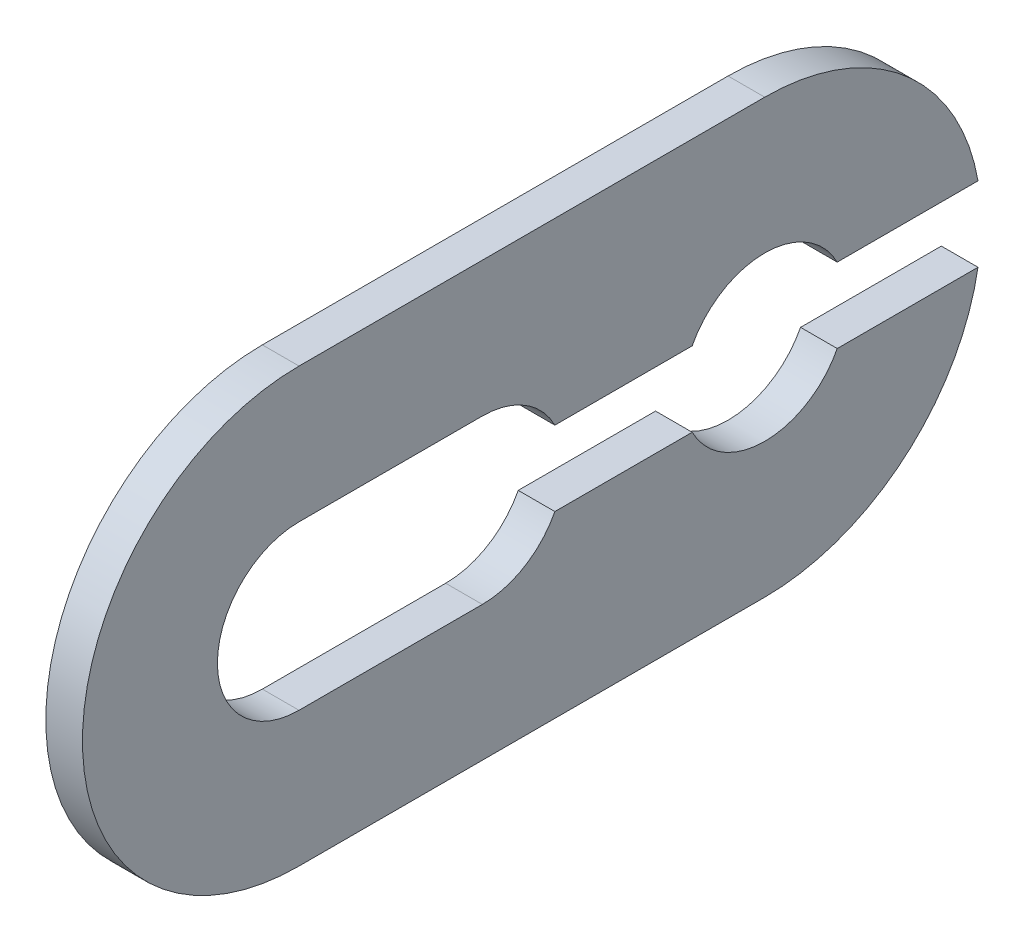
ISO-10303-21;
HEADER;
FILE_DESCRIPTION(('STEP AP214'),'2;1');
FILE_NAME('part.step','',(''),(''),'','','');
FILE_SCHEMA(('AUTOMOTIVE_DESIGN { 1 0 10303 214 1 1 1 1 }'));
ENDSEC;
DATA;
#1=APPLICATION_CONTEXT('core data for automotive mechanical design processes');
#2=APPLICATION_PROTOCOL_DEFINITION('international standard','automotive_design',2000,#1);
#3=PRODUCT_CONTEXT('',#1,'mechanical');
#4=PRODUCT('Part','Part','',(#3));
#5=PRODUCT_RELATED_PRODUCT_CATEGORY('part','',(#4));
#6=PRODUCT_DEFINITION_FORMATION('','',#4);
#7=PRODUCT_DEFINITION_CONTEXT('part definition',#1,'design');
#8=PRODUCT_DEFINITION('design','',#6,#7);
#9=PRODUCT_DEFINITION_SHAPE('','',#8);
#10=(LENGTH_UNIT() NAMED_UNIT(*) SI_UNIT(.MILLI.,.METRE.));
#11=(NAMED_UNIT(*) PLANE_ANGLE_UNIT() SI_UNIT($,.RADIAN.));
#12=(NAMED_UNIT(*) SI_UNIT($,.STERADIAN.) SOLID_ANGLE_UNIT());
#13=UNCERTAINTY_MEASURE_WITH_UNIT(LENGTH_MEASURE(1.E-05),#10,'distance_accuracy_value','');
#14=(GEOMETRIC_REPRESENTATION_CONTEXT(3) GLOBAL_UNCERTAINTY_ASSIGNED_CONTEXT((#13)) GLOBAL_UNIT_ASSIGNED_CONTEXT((#10,
#11,#12)) REPRESENTATION_CONTEXT('',''));
#15=CARTESIAN_POINT('',(0.,0.,0.));
#16=DIRECTION('',(0.,0.,1.));
#17=DIRECTION('',(1.,0.,0.));
#18=AXIS2_PLACEMENT_3D('',#15,#16,#17);
#19=CARTESIAN_POINT('',(230.88345296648,-103.885728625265,46.65));
#20=DIRECTION('',(-1.,0.,0.));
#21=DIRECTION('',(0.,0.,1.));
#22=AXIS2_PLACEMENT_3D('',#19,#20,#21);
#23=CYLINDRICAL_SURFACE('',#22,2.225);
#24=CARTESIAN_POINT('',(229.88345296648,-103.885728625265,46.65));
#25=DIRECTION('',(-1.,0.,0.));
#26=DIRECTION('',(0.,0.,1.));
#27=AXIS2_PLACEMENT_3D('',#24,#25,#26);
#28=CIRCLE('',#27,2.225);
#29=CARTESIAN_POINT('',(229.88345296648,-104.905810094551,44.672613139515));
#30=VERTEX_POINT('',#29);
#31=CARTESIAN_POINT('',(229.88345296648,-104.905810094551,48.627386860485));
#32=VERTEX_POINT('',#31);
#33=EDGE_CURVE('E10',#30,#32,#28,.T.);
#34=ORIENTED_EDGE('',*,*,#33,.T.);
#35=DIRECTION('',(-1.,0.,0.));
#36=VECTOR('',#35,1.);
#37=CARTESIAN_POINT('',(230.88345296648,-104.905810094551,48.627386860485));
#38=LINE('',#37,#36);
#39=CARTESIAN_POINT('',(230.88345296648,-104.905810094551,48.627386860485));
#40=VERTEX_POINT('',#39);
#41=EDGE_CURVE('E35',#40,#32,#38,.T.);
#42=ORIENTED_EDGE('',*,*,#41,.F.);
#43=CARTESIAN_POINT('',(230.88345296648,-103.885728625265,46.65));
#44=DIRECTION('',(-1.,0.,0.));
#45=DIRECTION('',(0.,0.,1.));
#46=AXIS2_PLACEMENT_3D('',#43,#44,#45);
#47=CIRCLE('',#46,2.225);
#48=CARTESIAN_POINT('',(230.88345296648,-104.905810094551,44.672613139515));
#49=VERTEX_POINT('',#48);
#50=EDGE_CURVE('E137',#49,#40,#47,.T.);
#51=ORIENTED_EDGE('',*,*,#50,.F.);
#52=DIRECTION('',(-1.,0.,0.));
#53=VECTOR('',#52,1.);
#54=CARTESIAN_POINT('',(230.88345296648,-104.905810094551,44.672613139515));
#55=LINE('',#54,#53);
#56=EDGE_CURVE('E26',#49,#30,#55,.T.);
#57=ORIENTED_EDGE('',*,*,#56,.T.);
#58=EDGE_LOOP('',(#34,#42,#51,#57));
#59=FACE_BOUND('',#58,.T.);
#60=ADVANCED_FACE('F16',(#59),#23,.F.);
#61=CARTESIAN_POINT('',(230.88345296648,-104.905810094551,48.627386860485));
#62=DIRECTION('',(0.,1.,0.));
#63=DIRECTION('',(0.,0.,1.));
#64=AXIS2_PLACEMENT_3D('',#61,#62,#63);
#65=PLANE('',#64);
#66=DIRECTION('',(0.,0.,1.));
#67=VECTOR('',#66,1.);
#68=CARTESIAN_POINT('',(229.88345296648,-104.905810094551,48.627386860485));
#69=LINE('',#68,#67);
#70=CARTESIAN_POINT('',(229.88345296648,-104.905810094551,52.3726131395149));
#71=VERTEX_POINT('',#70);
#72=EDGE_CURVE('E243',#32,#71,#69,.T.);
#73=ORIENTED_EDGE('',*,*,#72,.T.);
#74=DIRECTION('',(-1.,0.,0.));
#75=VECTOR('',#74,1.);
#76=CARTESIAN_POINT('',(230.88345296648,-104.905810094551,52.3726131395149));
#77=LINE('',#76,#75);
#78=CARTESIAN_POINT('',(230.88345296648,-104.905810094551,52.3726131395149));
#79=VERTEX_POINT('',#78);
#80=EDGE_CURVE('E235',#79,#71,#77,.T.);
#81=ORIENTED_EDGE('',*,*,#80,.F.);
#82=DIRECTION('',(0.,0.,-1.));
#83=VECTOR('',#82,1.);
#84=CARTESIAN_POINT('',(230.88345296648,-104.905810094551,52.3726131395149));
#85=LINE('',#84,#83);
#86=EDGE_CURVE('E241',#79,#40,#85,.T.);
#87=ORIENTED_EDGE('',*,*,#86,.T.);
#88=ORIENTED_EDGE('',*,*,#41,.T.);
#89=EDGE_LOOP('',(#73,#81,#87,#88));
#90=FACE_BOUND('',#89,.T.);
#91=ADVANCED_FACE('F253',(#90),#65,.T.);
#92=CARTESIAN_POINT('',(230.88345296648,-103.885728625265,54.35));
#93=DIRECTION('',(-1.,0.,0.));
#94=DIRECTION('',(0.,0.,1.));
#95=AXIS2_PLACEMENT_3D('',#92,#93,#94);
#96=CYLINDRICAL_SURFACE('',#95,2.225);
#97=CARTESIAN_POINT('',(229.88345296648,-103.885728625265,54.35));
#98=DIRECTION('',(-1.,0.,0.));
#99=DIRECTION('',(0.,0.,1.));
#100=AXIS2_PLACEMENT_3D('',#97,#98,#99);
#101=CIRCLE('',#100,2.225);
#102=CARTESIAN_POINT('',(229.88345296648,-106.110728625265,54.35));
#103=VERTEX_POINT('',#102);
#104=EDGE_CURVE('E238',#71,#103,#101,.T.);
#105=ORIENTED_EDGE('',*,*,#104,.T.);
#106=DIRECTION('',(-1.,0.,0.));
#107=VECTOR('',#106,1.);
#108=CARTESIAN_POINT('',(230.88345296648,-106.110728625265,54.35));
#109=LINE('',#108,#107);
#110=CARTESIAN_POINT('',(230.88345296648,-106.110728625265,54.35));
#111=VERTEX_POINT('',#110);
#112=EDGE_CURVE('E227',#111,#103,#109,.T.);
#113=ORIENTED_EDGE('',*,*,#112,.F.);
#114=CARTESIAN_POINT('',(230.88345296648,-103.885728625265,54.35));
#115=DIRECTION('',(-1.,0.,0.));
#116=DIRECTION('',(0.,0.,1.));
#117=AXIS2_PLACEMENT_3D('',#114,#115,#116);
#118=CIRCLE('',#117,2.225);
#119=EDGE_CURVE('E222',#79,#111,#118,.T.);
#120=ORIENTED_EDGE('',*,*,#119,.F.);
#121=ORIENTED_EDGE('',*,*,#80,.T.);
#122=EDGE_LOOP('',(#105,#113,#120,#121));
#123=FACE_BOUND('',#122,.T.);
#124=ADVANCED_FACE('F256',(#123),#96,.F.);
#125=CARTESIAN_POINT('',(230.88345296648,-106.110728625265,54.35));
#126=DIRECTION('',(0.,1.,0.));
#127=DIRECTION('',(0.,0.,1.));
#128=AXIS2_PLACEMENT_3D('',#125,#126,#127);
#129=PLANE('',#128);
#130=DIRECTION('',(0.,0.,1.));
#131=VECTOR('',#130,1.);
#132=CARTESIAN_POINT('',(229.88345296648,-106.110728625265,54.35));
#133=LINE('',#132,#131);
#134=CARTESIAN_POINT('',(229.88345296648,-106.110728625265,59.35));
#135=VERTEX_POINT('',#134);
#136=EDGE_CURVE('E231',#103,#135,#133,.T.);
#137=ORIENTED_EDGE('',*,*,#136,.T.);
#138=DIRECTION('',(-1.,0.,0.));
#139=VECTOR('',#138,1.);
#140=CARTESIAN_POINT('',(230.88345296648,-106.110728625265,59.35));
#141=LINE('',#140,#139);
#142=CARTESIAN_POINT('',(230.88345296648,-106.110728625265,59.35));
#143=VERTEX_POINT('',#142);
#144=EDGE_CURVE('E220',#143,#135,#141,.T.);
#145=ORIENTED_EDGE('',*,*,#144,.F.);
#146=DIRECTION('',(0.,0.,-1.));
#147=VECTOR('',#146,1.);
#148=CARTESIAN_POINT('',(230.88345296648,-106.110728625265,59.35));
#149=LINE('',#148,#147);
#150=EDGE_CURVE('E228',#143,#111,#149,.T.);
#151=ORIENTED_EDGE('',*,*,#150,.T.);
#152=ORIENTED_EDGE('',*,*,#112,.T.);
#153=EDGE_LOOP('',(#137,#145,#151,#152));
#154=FACE_BOUND('',#153,.T.);
#155=ADVANCED_FACE('F306',(#154),#129,.T.);
#156=CARTESIAN_POINT('',(230.88345296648,-103.885728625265,59.35));
#157=DIRECTION('',(-1.,0.,0.));
#158=DIRECTION('',(0.,0.,1.));
#159=AXIS2_PLACEMENT_3D('',#156,#157,#158);
#160=CYLINDRICAL_SURFACE('',#159,2.225);
#161=CARTESIAN_POINT('',(229.88345296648,-103.885728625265,59.35));
#162=DIRECTION('',(-1.,0.,0.));
#163=DIRECTION('',(0.,0.,1.));
#164=AXIS2_PLACEMENT_3D('',#161,#162,#163);
#165=CIRCLE('',#164,2.225);
#166=CARTESIAN_POINT('',(229.88345296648,-101.660728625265,59.35));
#167=VERTEX_POINT('',#166);
#168=EDGE_CURVE('E224',#135,#167,#165,.T.);
#169=ORIENTED_EDGE('',*,*,#168,.T.);
#170=DIRECTION('',(-1.,0.,0.));
#171=VECTOR('',#170,1.);
#172=CARTESIAN_POINT('',(230.88345296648,-101.660728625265,59.35));
#173=LINE('',#172,#171);
#174=CARTESIAN_POINT('',(230.88345296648,-101.660728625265,59.35));
#175=VERTEX_POINT('',#174);
#176=EDGE_CURVE('E213',#175,#167,#173,.T.);
#177=ORIENTED_EDGE('',*,*,#176,.F.);
#178=CARTESIAN_POINT('',(230.88345296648,-103.885728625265,59.35));
#179=DIRECTION('',(-1.,0.,0.));
#180=DIRECTION('',(0.,0.,1.));
#181=AXIS2_PLACEMENT_3D('',#178,#179,#180);
#182=CIRCLE('',#181,2.225);
#183=EDGE_CURVE('E215',#143,#175,#182,.T.);
#184=ORIENTED_EDGE('',*,*,#183,.F.);
#185=ORIENTED_EDGE('',*,*,#144,.T.);
#186=EDGE_LOOP('',(#169,#177,#184,#185));
#187=FACE_BOUND('',#186,.T.);
#188=ADVANCED_FACE('F264',(#187),#160,.F.);
#189=CARTESIAN_POINT('',(230.88345296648,-101.660728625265,59.35));
#190=DIRECTION('',(0.,-1.,0.));
#191=DIRECTION('',(0.,0.,-1.));
#192=AXIS2_PLACEMENT_3D('',#189,#190,#191);
#193=PLANE('',#192);
#194=DIRECTION('',(0.,0.,-1.));
#195=VECTOR('',#194,1.);
#196=CARTESIAN_POINT('',(229.88345296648,-101.660728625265,59.35));
#197=LINE('',#196,#195);
#198=CARTESIAN_POINT('',(229.88345296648,-101.660728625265,54.35));
#199=VERTEX_POINT('',#198);
#200=EDGE_CURVE('E217',#167,#199,#197,.T.);
#201=ORIENTED_EDGE('',*,*,#200,.T.);
#202=DIRECTION('',(-1.,0.,0.));
#203=VECTOR('',#202,1.);
#204=CARTESIAN_POINT('',(230.88345296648,-101.660728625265,54.35));
#205=LINE('',#204,#203);
#206=CARTESIAN_POINT('',(230.88345296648,-101.660728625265,54.35));
#207=VERTEX_POINT('',#206);
#208=EDGE_CURVE('E206',#207,#199,#205,.T.);
#209=ORIENTED_EDGE('',*,*,#208,.F.);
#210=DIRECTION('',(0.,0.,-1.));
#211=VECTOR('',#210,1.);
#212=CARTESIAN_POINT('',(230.88345296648,-101.660728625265,59.35));
#213=LINE('',#212,#211);
#214=EDGE_CURVE('E208',#175,#207,#213,.T.);
#215=ORIENTED_EDGE('',*,*,#214,.F.);
#216=ORIENTED_EDGE('',*,*,#176,.T.);
#217=EDGE_LOOP('',(#201,#209,#215,#216));
#218=FACE_BOUND('',#217,.T.);
#219=ADVANCED_FACE('F270',(#218),#193,.T.);
#220=CARTESIAN_POINT('',(230.88345296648,-103.885728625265,54.35));
#221=DIRECTION('',(-1.,0.,0.));
#222=DIRECTION('',(0.,0.,1.));
#223=AXIS2_PLACEMENT_3D('',#220,#221,#222);
#224=CYLINDRICAL_SURFACE('',#223,2.225);
#225=CARTESIAN_POINT('',(229.88345296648,-103.885728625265,54.35));
#226=DIRECTION('',(-1.,0.,0.));
#227=DIRECTION('',(0.,0.,1.));
#228=AXIS2_PLACEMENT_3D('',#225,#226,#227);
#229=CIRCLE('',#228,2.225);
#230=CARTESIAN_POINT('',(229.88345296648,-102.865647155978,52.372613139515));
#231=VERTEX_POINT('',#230);
#232=EDGE_CURVE('E210',#199,#231,#229,.T.);
#233=ORIENTED_EDGE('',*,*,#232,.T.);
#234=DIRECTION('',(-1.,0.,0.));
#235=VECTOR('',#234,1.);
#236=CARTESIAN_POINT('',(230.88345296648,-102.865647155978,52.372613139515));
#237=LINE('',#236,#235);
#238=CARTESIAN_POINT('',(230.88345296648,-102.865647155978,52.372613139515));
#239=VERTEX_POINT('',#238);
#240=EDGE_CURVE('E199',#239,#231,#237,.T.);
#241=ORIENTED_EDGE('',*,*,#240,.F.);
#242=CARTESIAN_POINT('',(230.88345296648,-103.885728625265,54.35));
#243=DIRECTION('',(-1.,0.,0.));
#244=DIRECTION('',(0.,0.,1.));
#245=AXIS2_PLACEMENT_3D('',#242,#243,#244);
#246=CIRCLE('',#245,2.225);
#247=EDGE_CURVE('E201',#207,#239,#246,.T.);
#248=ORIENTED_EDGE('',*,*,#247,.F.);
#249=ORIENTED_EDGE('',*,*,#208,.T.);
#250=EDGE_LOOP('',(#233,#241,#248,#249));
#251=FACE_BOUND('',#250,.T.);
#252=ADVANCED_FACE('F276',(#251),#224,.F.);
#253=CARTESIAN_POINT('',(230.88345296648,-102.865647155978,52.372613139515));
#254=DIRECTION('',(0.,-1.,0.));
#255=DIRECTION('',(0.,0.,-1.));
#256=AXIS2_PLACEMENT_3D('',#253,#254,#255);
#257=PLANE('',#256);
#258=DIRECTION('',(0.,0.,-1.));
#259=VECTOR('',#258,1.);
#260=CARTESIAN_POINT('',(229.88345296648,-102.865647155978,52.372613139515));
#261=LINE('',#260,#259);
#262=CARTESIAN_POINT('',(229.88345296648,-102.865647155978,48.627386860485));
#263=VERTEX_POINT('',#262);
#264=EDGE_CURVE('E203',#231,#263,#261,.T.);
#265=ORIENTED_EDGE('',*,*,#264,.T.);
#266=DIRECTION('',(-1.,0.,0.));
#267=VECTOR('',#266,1.);
#268=CARTESIAN_POINT('',(230.88345296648,-102.865647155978,48.627386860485));
#269=LINE('',#268,#267);
#270=CARTESIAN_POINT('',(230.88345296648,-102.865647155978,48.627386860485));
#271=VERTEX_POINT('',#270);
#272=EDGE_CURVE('E192',#271,#263,#269,.T.);
#273=ORIENTED_EDGE('',*,*,#272,.F.);
#274=DIRECTION('',(0.,0.,-1.));
#275=VECTOR('',#274,1.);
#276=CARTESIAN_POINT('',(230.88345296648,-102.865647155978,52.372613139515));
#277=LINE('',#276,#275);
#278=EDGE_CURVE('E194',#239,#271,#277,.T.);
#279=ORIENTED_EDGE('',*,*,#278,.F.);
#280=ORIENTED_EDGE('',*,*,#240,.T.);
#281=EDGE_LOOP('',(#265,#273,#279,#280));
#282=FACE_BOUND('',#281,.T.);
#283=ADVANCED_FACE('F280',(#282),#257,.T.);
#284=CARTESIAN_POINT('',(230.88345296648,-103.885728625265,46.65));
#285=DIRECTION('',(-1.,0.,0.));
#286=DIRECTION('',(0.,0.,1.));
#287=AXIS2_PLACEMENT_3D('',#284,#285,#286);
#288=CYLINDRICAL_SURFACE('',#287,2.225);
#289=CARTESIAN_POINT('',(229.88345296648,-103.885728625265,46.65));
#290=DIRECTION('',(-1.,0.,0.));
#291=DIRECTION('',(0.,0.,1.));
#292=AXIS2_PLACEMENT_3D('',#289,#290,#291);
#293=CIRCLE('',#292,2.225);
#294=CARTESIAN_POINT('',(229.88345296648,-102.865647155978,44.672613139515));
#295=VERTEX_POINT('',#294);
#296=EDGE_CURVE('E196',#263,#295,#293,.T.);
#297=ORIENTED_EDGE('',*,*,#296,.T.);
#298=DIRECTION('',(-1.,0.,0.));
#299=VECTOR('',#298,1.);
#300=CARTESIAN_POINT('',(230.88345296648,-102.865647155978,44.672613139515));
#301=LINE('',#300,#299);
#302=CARTESIAN_POINT('',(230.88345296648,-102.865647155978,44.672613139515));
#303=VERTEX_POINT('',#302);
#304=EDGE_CURVE('E185',#303,#295,#301,.T.);
#305=ORIENTED_EDGE('',*,*,#304,.F.);
#306=CARTESIAN_POINT('',(230.88345296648,-103.885728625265,46.65));
#307=DIRECTION('',(-1.,0.,0.));
#308=DIRECTION('',(0.,0.,1.));
#309=AXIS2_PLACEMENT_3D('',#306,#307,#308);
#310=CIRCLE('',#309,2.225);
#311=EDGE_CURVE('E187',#271,#303,#310,.T.);
#312=ORIENTED_EDGE('',*,*,#311,.F.);
#313=ORIENTED_EDGE('',*,*,#272,.T.);
#314=EDGE_LOOP('',(#297,#305,#312,#313));
#315=FACE_BOUND('',#314,.T.);
#316=ADVANCED_FACE('F285',(#315),#288,.F.);
#317=CARTESIAN_POINT('',(230.88345296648,-102.865647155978,44.672613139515));
#318=DIRECTION('',(0.,-1.,0.));
#319=DIRECTION('',(0.,0.,-1.));
#320=AXIS2_PLACEMENT_3D('',#317,#318,#319);
#321=PLANE('',#320);
#322=DIRECTION('',(0.,0.,-1.));
#323=VECTOR('',#322,1.);
#324=CARTESIAN_POINT('',(229.88345296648,-102.865647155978,44.672613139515));
#325=LINE('',#324,#323);
#326=CARTESIAN_POINT('',(229.88345296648,-102.865647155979,40.833776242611));
#327=VERTEX_POINT('',#326);
#328=EDGE_CURVE('E189',#295,#327,#325,.T.);
#329=ORIENTED_EDGE('',*,*,#328,.T.);
#330=DIRECTION('',(-1.,0.,0.));
#331=VECTOR('',#330,1.);
#332=CARTESIAN_POINT('',(230.88345296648,-102.865647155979,40.833776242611));
#333=LINE('',#332,#331);
#334=CARTESIAN_POINT('',(230.88345296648,-102.865647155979,40.833776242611));
#335=VERTEX_POINT('',#334);
#336=EDGE_CURVE('E177',#335,#327,#333,.T.);
#337=ORIENTED_EDGE('',*,*,#336,.F.);
#338=DIRECTION('',(0.,0.,-1.));
#339=VECTOR('',#338,1.);
#340=CARTESIAN_POINT('',(230.88345296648,-102.865647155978,44.672613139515));
#341=LINE('',#340,#339);
#342=EDGE_CURVE('E156',#303,#335,#341,.T.);
#343=ORIENTED_EDGE('',*,*,#342,.F.);
#344=ORIENTED_EDGE('',*,*,#304,.T.);
#345=EDGE_LOOP('',(#329,#337,#343,#344));
#346=FACE_BOUND('',#345,.T.);
#347=ADVANCED_FACE('F291',(#346),#321,.T.);
#348=CARTESIAN_POINT('',(230.88345296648,-103.885728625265,46.6500000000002));
#349=DIRECTION('',(-1.,0.,0.));
#350=DIRECTION('',(0.,0.,1.));
#351=AXIS2_PLACEMENT_3D('',#348,#349,#350);
#352=CYLINDRICAL_SURFACE('',#351,5.905);
#353=CARTESIAN_POINT('',(229.88345296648,-103.885728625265,46.6500000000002));
#354=DIRECTION('',(1.,0.,0.));
#355=DIRECTION('',(0.,1.,0.));
#356=AXIS2_PLACEMENT_3D('',#353,#354,#355);
#357=CIRCLE('',#356,5.905);
#358=CARTESIAN_POINT('',(229.88345296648,-97.9807286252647,46.6500000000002));
#359=VERTEX_POINT('',#358);
#360=EDGE_CURVE('E181',#327,#359,#357,.T.);
#361=ORIENTED_EDGE('',*,*,#360,.T.);
#362=DIRECTION('',(-1.,0.,0.));
#363=VECTOR('',#362,1.);
#364=CARTESIAN_POINT('',(230.88345296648,-97.9807286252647,46.6500000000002));
#365=LINE('',#364,#363);
#366=CARTESIAN_POINT('',(230.88345296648,-97.9807286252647,46.6500000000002));
#367=VERTEX_POINT('',#366);
#368=EDGE_CURVE('E169',#367,#359,#365,.T.);
#369=ORIENTED_EDGE('',*,*,#368,.F.);
#370=CARTESIAN_POINT('',(230.88345296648,-103.885728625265,46.6500000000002));
#371=DIRECTION('',(-1.,0.,0.));
#372=DIRECTION('',(0.,0.,1.));
#373=AXIS2_PLACEMENT_3D('',#370,#371,#372);
#374=CIRCLE('',#373,5.905);
#375=EDGE_CURVE('E178',#367,#335,#374,.T.);
#376=ORIENTED_EDGE('',*,*,#375,.T.);
#377=ORIENTED_EDGE('',*,*,#336,.T.);
#378=EDGE_LOOP('',(#361,#369,#376,#377));
#379=FACE_BOUND('',#378,.T.);
#380=ADVANCED_FACE('F295',(#379),#352,.T.);
#381=CARTESIAN_POINT('',(230.88345296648,-97.9807286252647,46.6500000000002));
#382=DIRECTION('',(0.,1.,0.));
#383=DIRECTION('',(0.,0.,1.));
#384=AXIS2_PLACEMENT_3D('',#381,#382,#383);
#385=PLANE('',#384);
#386=DIRECTION('',(0.,0.,1.));
#387=VECTOR('',#386,1.);
#388=CARTESIAN_POINT('',(229.88345296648,-97.9807286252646,46.6500000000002));
#389=LINE('',#388,#387);
#390=CARTESIAN_POINT('',(229.88345296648,-97.9807286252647,59.35));
#391=VERTEX_POINT('',#390);
#392=EDGE_CURVE('E173',#359,#391,#389,.T.);
#393=ORIENTED_EDGE('',*,*,#392,.T.);
#394=DIRECTION('',(-1.,0.,0.));
#395=VECTOR('',#394,1.);
#396=CARTESIAN_POINT('',(230.88345296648,-97.9807286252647,59.35));
#397=LINE('',#396,#395);
#398=CARTESIAN_POINT('',(230.88345296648,-97.9807286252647,59.35));
#399=VERTEX_POINT('',#398);
#400=EDGE_CURVE('E161',#399,#391,#397,.T.);
#401=ORIENTED_EDGE('',*,*,#400,.F.);
#402=DIRECTION('',(0.,0.,-1.));
#403=VECTOR('',#402,1.);
#404=CARTESIAN_POINT('',(230.88345296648,-97.9807286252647,59.35));
#405=LINE('',#404,#403);
#406=EDGE_CURVE('E170',#399,#367,#405,.T.);
#407=ORIENTED_EDGE('',*,*,#406,.T.);
#408=ORIENTED_EDGE('',*,*,#368,.T.);
#409=EDGE_LOOP('',(#393,#401,#407,#408));
#410=FACE_BOUND('',#409,.T.);
#411=ADVANCED_FACE('F298',(#410),#385,.T.);
#412=CARTESIAN_POINT('',(230.88345296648,-103.885728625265,59.35));
#413=DIRECTION('',(-1.,0.,0.));
#414=DIRECTION('',(0.,0.,1.));
#415=AXIS2_PLACEMENT_3D('',#412,#413,#414);
#416=CYLINDRICAL_SURFACE('',#415,5.905);
#417=CARTESIAN_POINT('',(229.88345296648,-103.885728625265,59.35));
#418=DIRECTION('',(1.,0.,0.));
#419=DIRECTION('',(0.,1.,0.));
#420=AXIS2_PLACEMENT_3D('',#417,#418,#419);
#421=CIRCLE('',#420,5.905);
#422=CARTESIAN_POINT('',(229.88345296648,-109.790728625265,59.35));
#423=VERTEX_POINT('',#422);
#424=EDGE_CURVE('E165',#391,#423,#421,.T.);
#425=ORIENTED_EDGE('',*,*,#424,.T.);
#426=DIRECTION('',(-1.,0.,0.));
#427=VECTOR('',#426,1.);
#428=CARTESIAN_POINT('',(230.88345296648,-109.790728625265,59.35));
#429=LINE('',#428,#427);
#430=CARTESIAN_POINT('',(230.88345296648,-109.790728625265,59.35));
#431=VERTEX_POINT('',#430);
#432=EDGE_CURVE('E155',#431,#423,#429,.T.);
#433=ORIENTED_EDGE('',*,*,#432,.F.);
#434=CARTESIAN_POINT('',(230.88345296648,-103.885728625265,59.35));
#435=DIRECTION('',(-1.,0.,0.));
#436=DIRECTION('',(0.,0.,1.));
#437=AXIS2_PLACEMENT_3D('',#434,#435,#436);
#438=CIRCLE('',#437,5.905);
#439=EDGE_CURVE('E162',#431,#399,#438,.T.);
#440=ORIENTED_EDGE('',*,*,#439,.T.);
#441=ORIENTED_EDGE('',*,*,#400,.T.);
#442=EDGE_LOOP('',(#425,#433,#440,#441));
#443=FACE_BOUND('',#442,.T.);
#444=ADVANCED_FACE('F18',(#443),#416,.T.);
#445=CARTESIAN_POINT('',(230.88345296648,-109.790728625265,59.35));
#446=DIRECTION('',(0.,-1.,0.));
#447=DIRECTION('',(0.,0.,-1.));
#448=AXIS2_PLACEMENT_3D('',#445,#446,#447);
#449=PLANE('',#448);
#450=DIRECTION('',(0.,0.,-1.));
#451=VECTOR('',#450,1.);
#452=CARTESIAN_POINT('',(229.88345296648,-109.790728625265,59.35));
#453=LINE('',#452,#451);
#454=CARTESIAN_POINT('',(229.88345296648,-109.790728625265,46.6500000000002));
#455=VERTEX_POINT('',#454);
#456=EDGE_CURVE('E158',#423,#455,#453,.T.);
#457=ORIENTED_EDGE('',*,*,#456,.T.);
#458=DIRECTION('',(-1.,0.,0.));
#459=VECTOR('',#458,1.);
#460=CARTESIAN_POINT('',(230.88345296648,-109.790728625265,46.6500000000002));
#461=LINE('',#460,#459);
#462=CARTESIAN_POINT('',(230.88345296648,-109.790728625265,46.6500000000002));
#463=VERTEX_POINT('',#462);
#464=EDGE_CURVE('E146',#463,#455,#461,.T.);
#465=ORIENTED_EDGE('',*,*,#464,.F.);
#466=DIRECTION('',(0.,0.,-1.));
#467=VECTOR('',#466,1.);
#468=CARTESIAN_POINT('',(230.88345296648,-109.790728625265,59.35));
#469=LINE('',#468,#467);
#470=EDGE_CURVE('E144',#431,#463,#469,.T.);
#471=ORIENTED_EDGE('',*,*,#470,.F.);
#472=ORIENTED_EDGE('',*,*,#432,.T.);
#473=EDGE_LOOP('',(#457,#465,#471,#472));
#474=FACE_BOUND('',#473,.T.);
#475=ADVANCED_FACE('F303',(#474),#449,.T.);
#476=CARTESIAN_POINT('',(230.88345296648,-103.885728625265,46.6500000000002));
#477=DIRECTION('',(-1.,0.,0.));
#478=DIRECTION('',(0.,0.,1.));
#479=AXIS2_PLACEMENT_3D('',#476,#477,#478);
#480=CYLINDRICAL_SURFACE('',#479,5.905);
#481=CARTESIAN_POINT('',(229.88345296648,-103.885728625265,46.6500000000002));
#482=DIRECTION('',(1.,0.,0.));
#483=DIRECTION('',(0.,1.,0.));
#484=AXIS2_PLACEMENT_3D('',#481,#482,#483);
#485=CIRCLE('',#484,5.905);
#486=CARTESIAN_POINT('',(229.88345296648,-104.905810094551,40.833776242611));
#487=VERTEX_POINT('',#486);
#488=EDGE_CURVE('E135',#455,#487,#485,.T.);
#489=ORIENTED_EDGE('',*,*,#488,.T.);
#490=DIRECTION('',(-1.,0.,0.));
#491=VECTOR('',#490,1.);
#492=CARTESIAN_POINT('',(230.88345296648,-104.905810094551,40.833776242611));
#493=LINE('',#492,#491);
#494=CARTESIAN_POINT('',(230.88345296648,-104.905810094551,40.833776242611));
#495=VERTEX_POINT('',#494);
#496=EDGE_CURVE('E127',#495,#487,#493,.T.);
#497=ORIENTED_EDGE('',*,*,#496,.F.);
#498=CARTESIAN_POINT('',(230.88345296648,-103.885728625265,46.6500000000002));
#499=DIRECTION('',(-1.,0.,0.));
#500=DIRECTION('',(0.,0.,1.));
#501=AXIS2_PLACEMENT_3D('',#498,#499,#500);
#502=CIRCLE('',#501,5.905);
#503=EDGE_CURVE('E133',#495,#463,#502,.T.);
#504=ORIENTED_EDGE('',*,*,#503,.T.);
#505=ORIENTED_EDGE('',*,*,#464,.T.);
#506=EDGE_LOOP('',(#489,#497,#504,#505));
#507=FACE_BOUND('',#506,.T.);
#508=ADVANCED_FACE('F132',(#507),#480,.T.);
#509=CARTESIAN_POINT('',(230.88345296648,-104.905810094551,40.833776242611));
#510=DIRECTION('',(0.,1.,0.));
#511=DIRECTION('',(0.,0.,1.));
#512=AXIS2_PLACEMENT_3D('',#509,#510,#511);
#513=PLANE('',#512);
#514=DIRECTION('',(0.,0.,1.));
#515=VECTOR('',#514,1.);
#516=CARTESIAN_POINT('',(229.88345296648,-104.905810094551,40.833776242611));
#517=LINE('',#516,#515);
#518=EDGE_CURVE('E151',#487,#30,#517,.T.);
#519=ORIENTED_EDGE('',*,*,#518,.T.);
#520=ORIENTED_EDGE('',*,*,#56,.F.);
#521=DIRECTION('',(0.,0.,-1.));
#522=VECTOR('',#521,1.);
#523=CARTESIAN_POINT('',(230.88345296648,-104.905810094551,44.672613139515));
#524=LINE('',#523,#522);
#525=EDGE_CURVE('E20',#49,#495,#524,.T.);
#526=ORIENTED_EDGE('',*,*,#525,.T.);
#527=ORIENTED_EDGE('',*,*,#496,.T.);
#528=EDGE_LOOP('',(#519,#520,#526,#527));
#529=FACE_BOUND('',#528,.T.);
#530=ADVANCED_FACE('F149',(#529),#513,.T.);
#531=CARTESIAN_POINT('',(229.88345296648,-103.885728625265,52.5616536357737));
#532=DIRECTION('',(-1.,0.,0.));
#533=DIRECTION('',(0.,0.,1.));
#534=AXIS2_PLACEMENT_3D('',#531,#532,#533);
#535=PLANE('',#534);
#536=ORIENTED_EDGE('',*,*,#33,.F.);
#537=ORIENTED_EDGE('',*,*,#518,.F.);
#538=ORIENTED_EDGE('',*,*,#488,.F.);
#539=ORIENTED_EDGE('',*,*,#456,.F.);
#540=ORIENTED_EDGE('',*,*,#424,.F.);
#541=ORIENTED_EDGE('',*,*,#392,.F.);
#542=ORIENTED_EDGE('',*,*,#360,.F.);
#543=ORIENTED_EDGE('',*,*,#328,.F.);
#544=ORIENTED_EDGE('',*,*,#296,.F.);
#545=ORIENTED_EDGE('',*,*,#264,.F.);
#546=ORIENTED_EDGE('',*,*,#232,.F.);
#547=ORIENTED_EDGE('',*,*,#200,.F.);
#548=ORIENTED_EDGE('',*,*,#168,.F.);
#549=ORIENTED_EDGE('',*,*,#136,.F.);
#550=ORIENTED_EDGE('',*,*,#104,.F.);
#551=ORIENTED_EDGE('',*,*,#72,.F.);
#552=EDGE_LOOP('',(#536,#537,#538,#539,#540,#541,#542,#543,#544,#545,#546,#547,#548,#549,#550,#551));
#553=FACE_BOUND('',#552,.T.);
#554=ADVANCED_FACE('F305',(#553),#535,.T.);
#555=CARTESIAN_POINT('',(230.88345296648,-103.885728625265,52.5616536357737));
#556=DIRECTION('',(-1.,0.,0.));
#557=DIRECTION('',(0.,0.,1.));
#558=AXIS2_PLACEMENT_3D('',#555,#556,#557);
#559=PLANE('',#558);
#560=ORIENTED_EDGE('',*,*,#525,.F.);
#561=ORIENTED_EDGE('',*,*,#50,.T.);
#562=ORIENTED_EDGE('',*,*,#86,.F.);
#563=ORIENTED_EDGE('',*,*,#119,.T.);
#564=ORIENTED_EDGE('',*,*,#150,.F.);
#565=ORIENTED_EDGE('',*,*,#183,.T.);
#566=ORIENTED_EDGE('',*,*,#214,.T.);
#567=ORIENTED_EDGE('',*,*,#247,.T.);
#568=ORIENTED_EDGE('',*,*,#278,.T.);
#569=ORIENTED_EDGE('',*,*,#311,.T.);
#570=ORIENTED_EDGE('',*,*,#342,.T.);
#571=ORIENTED_EDGE('',*,*,#375,.F.);
#572=ORIENTED_EDGE('',*,*,#406,.F.);
#573=ORIENTED_EDGE('',*,*,#439,.F.);
#574=ORIENTED_EDGE('',*,*,#470,.T.);
#575=ORIENTED_EDGE('',*,*,#503,.F.);
#576=EDGE_LOOP('',(#560,#561,#562,#563,#564,#565,#566,#567,#568,#569,#570,#571,#572,#573,#574,#575));
#577=FACE_BOUND('',#576,.T.);
#578=ADVANCED_FACE('F141',(#577),#559,.F.);
#579=CLOSED_SHELL('',(#60,#91,#124,#155,#188,#219,#252,#283,#316,#347,#380,#411,#444,#475,#508,
#530,#554,#578));
#580=MANIFOLD_SOLID_BREP('B1',#579);
#581=ADVANCED_BREP_SHAPE_REPRESENTATION('',(#18,#580),#14);
#582=SHAPE_DEFINITION_REPRESENTATION(#9,#581);
ENDSEC;
END-ISO-10303-21;
